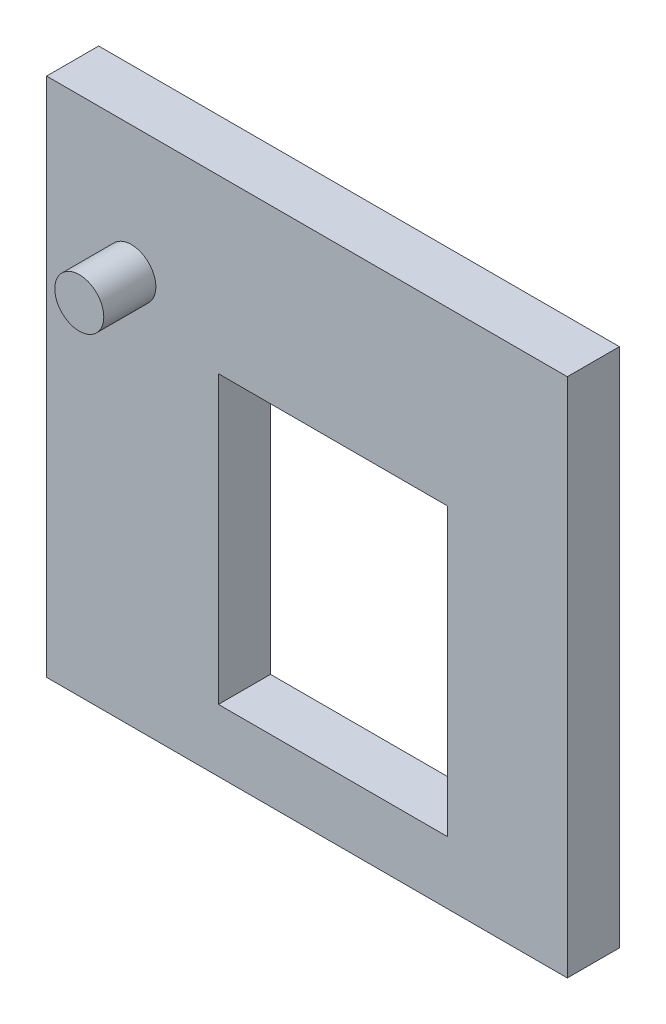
ISO-10303-21;
HEADER;
FILE_DESCRIPTION(('STEP AP214'),'2;1');
FILE_NAME('part.step','',(''),(''),'','','');
FILE_SCHEMA(('AUTOMOTIVE_DESIGN { 1 0 10303 214 1 1 1 1 }'));
ENDSEC;
DATA;
#1=APPLICATION_CONTEXT('core data for automotive mechanical design processes');
#2=APPLICATION_PROTOCOL_DEFINITION('international standard','automotive_design',2000,#1);
#3=PRODUCT_CONTEXT('',#1,'mechanical');
#4=PRODUCT('Part','Part','',(#3));
#5=PRODUCT_RELATED_PRODUCT_CATEGORY('part','',(#4));
#6=PRODUCT_DEFINITION_FORMATION('','',#4);
#7=PRODUCT_DEFINITION_CONTEXT('part definition',#1,'design');
#8=PRODUCT_DEFINITION('design','',#6,#7);
#9=PRODUCT_DEFINITION_SHAPE('','',#8);
#10=(LENGTH_UNIT() NAMED_UNIT(*) SI_UNIT(.MILLI.,.METRE.));
#11=(NAMED_UNIT(*) PLANE_ANGLE_UNIT() SI_UNIT($,.RADIAN.));
#12=(NAMED_UNIT(*) SI_UNIT($,.STERADIAN.) SOLID_ANGLE_UNIT());
#13=UNCERTAINTY_MEASURE_WITH_UNIT(LENGTH_MEASURE(1.E-05),#10,'distance_accuracy_value','');
#14=(GEOMETRIC_REPRESENTATION_CONTEXT(3) GLOBAL_UNCERTAINTY_ASSIGNED_CONTEXT((#13)) GLOBAL_UNIT_ASSIGNED_CONTEXT((#10,
#11,#12)) REPRESENTATION_CONTEXT('',''));
#15=CARTESIAN_POINT('',(0.,0.,0.));
#16=DIRECTION('',(0.,0.,1.));
#17=DIRECTION('',(1.,0.,0.));
#18=AXIS2_PLACEMENT_3D('',#15,#16,#17);
#19=CARTESIAN_POINT('',(-50.,-50.,5.));
#20=DIRECTION('',(0.,0.,-1.));
#21=DIRECTION('',(-1.,0.,0.));
#22=AXIS2_PLACEMENT_3D('',#19,#20,#21);
#23=PLANE('',#22);
#24=DIRECTION('',(-1.,0.,0.));
#25=VECTOR('',#24,1.);
#26=CARTESIAN_POINT('',(-50.,-50.,5.));
#27=LINE('',#26,#25);
#28=CARTESIAN_POINT('',(50.,-50.,5.));
#29=VERTEX_POINT('',#28);
#30=CARTESIAN_POINT('',(-50.,-50.,5.));
#31=VERTEX_POINT('',#30);
#32=EDGE_CURVE('E133',#29,#31,#27,.T.);
#33=ORIENTED_EDGE('',*,*,#32,.F.);
#34=DIRECTION('',(0.,-1.,0.));
#35=VECTOR('',#34,1.);
#36=CARTESIAN_POINT('',(50.,-50.,5.));
#37=LINE('',#36,#35);
#38=CARTESIAN_POINT('',(50.,50.,5.));
#39=VERTEX_POINT('',#38);
#40=EDGE_CURVE('E141',#39,#29,#37,.T.);
#41=ORIENTED_EDGE('',*,*,#40,.F.);
#42=DIRECTION('',(1.,0.,0.));
#43=VECTOR('',#42,1.);
#44=CARTESIAN_POINT('',(-50.,50.,5.));
#45=LINE('',#44,#43);
#46=CARTESIAN_POINT('',(-50.,50.,5.));
#47=VERTEX_POINT('',#46);
#48=EDGE_CURVE('E152',#47,#39,#45,.T.);
#49=ORIENTED_EDGE('',*,*,#48,.F.);
#50=DIRECTION('',(0.,1.,0.));
#51=VECTOR('',#50,1.);
#52=CARTESIAN_POINT('',(-50.,50.,5.));
#53=LINE('',#52,#51);
#54=EDGE_CURVE('E150',#31,#47,#53,.T.);
#55=ORIENTED_EDGE('',*,*,#54,.F.);
#56=EDGE_LOOP('',(#33,#41,#49,#55));
#57=FACE_BOUND('',#56,.T.);
#58=DIRECTION('',(1.,0.,0.));
#59=VECTOR('',#58,1.);
#60=CARTESIAN_POINT('',(-17.,-38.,5.));
#61=LINE('',#60,#59);
#62=CARTESIAN_POINT('',(-17.,-38.,5.));
#63=VERTEX_POINT('',#62);
#64=CARTESIAN_POINT('',(27.,-38.,5.));
#65=VERTEX_POINT('',#64);
#66=EDGE_CURVE('E127',#63,#65,#61,.T.);
#67=ORIENTED_EDGE('',*,*,#66,.F.);
#68=DIRECTION('',(0.,-1.,0.));
#69=VECTOR('',#68,1.);
#70=CARTESIAN_POINT('',(-17.,-38.,5.));
#71=LINE('',#70,#69);
#72=CARTESIAN_POINT('',(-17.,17.,5.));
#73=VERTEX_POINT('',#72);
#74=EDGE_CURVE('E56',#73,#63,#71,.T.);
#75=ORIENTED_EDGE('',*,*,#74,.F.);
#76=DIRECTION('',(-1.,0.,0.));
#77=VECTOR('',#76,1.);
#78=CARTESIAN_POINT('',(-17.,17.,5.));
#79=LINE('',#78,#77);
#80=CARTESIAN_POINT('',(27.,17.,5.));
#81=VERTEX_POINT('',#80);
#82=EDGE_CURVE('E116',#81,#73,#79,.T.);
#83=ORIENTED_EDGE('',*,*,#82,.F.);
#84=DIRECTION('',(0.,1.,0.));
#85=VECTOR('',#84,1.);
#86=CARTESIAN_POINT('',(27.,-38.,5.));
#87=LINE('',#86,#85);
#88=EDGE_CURVE('E119',#65,#81,#87,.T.);
#89=ORIENTED_EDGE('',*,*,#88,.F.);
#90=EDGE_LOOP('',(#67,#75,#83,#89));
#91=FACE_BOUND('',#90,.T.);
#92=CARTESIAN_POINT('',(-33.7210658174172,25.4187198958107,5.));
#93=DIRECTION('',(0.,0.,-1.));
#94=DIRECTION('',(-1.,0.,0.));
#95=AXIS2_PLACEMENT_3D('',#92,#93,#94);
#96=CIRCLE('',#95,4.70284837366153);
#97=CARTESIAN_POINT('',(-38.4239141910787,25.4187198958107,5.));
#98=VERTEX_POINT('',#97);
#99=EDGE_CURVE('E11',#98,#98,#96,.F.);
#100=ORIENTED_EDGE('',*,*,#99,.F.);
#101=EDGE_LOOP('',(#100));
#102=FACE_BOUND('',#101,.T.);
#103=ADVANCED_FACE('F33',(#57,#91,#102),#23,.F.);
#104=CARTESIAN_POINT('',(-50.,-50.,-5.));
#105=DIRECTION('',(0.,1.,0.));
#106=DIRECTION('',(0.,0.,1.));
#107=AXIS2_PLACEMENT_3D('',#104,#105,#106);
#108=PLANE('',#107);
#109=ORIENTED_EDGE('',*,*,#32,.T.);
#110=DIRECTION('',(0.,0.,1.));
#111=VECTOR('',#110,1.);
#112=CARTESIAN_POINT('',(-50.,-50.,-5.));
#113=LINE('',#112,#111);
#114=CARTESIAN_POINT('',(-50.,-50.,-5.));
#115=VERTEX_POINT('',#114);
#116=EDGE_CURVE('E41',#115,#31,#113,.T.);
#117=ORIENTED_EDGE('',*,*,#116,.F.);
#118=DIRECTION('',(-1.,0.,0.));
#119=VECTOR('',#118,1.);
#120=CARTESIAN_POINT('',(-50.,-50.,-5.));
#121=LINE('',#120,#119);
#122=CARTESIAN_POINT('',(50.,-50.,-5.));
#123=VERTEX_POINT('',#122);
#124=EDGE_CURVE('E137',#123,#115,#121,.T.);
#125=ORIENTED_EDGE('',*,*,#124,.F.);
#126=DIRECTION('',(0.,0.,1.));
#127=VECTOR('',#126,1.);
#128=CARTESIAN_POINT('',(50.,-50.,-5.));
#129=LINE('',#128,#127);
#130=EDGE_CURVE('E147',#123,#29,#129,.T.);
#131=ORIENTED_EDGE('',*,*,#130,.T.);
#132=EDGE_LOOP('',(#109,#117,#125,#131));
#133=FACE_BOUND('',#132,.T.);
#134=ADVANCED_FACE('F35',(#133),#108,.F.);
#135=CARTESIAN_POINT('',(-50.,50.,-5.));
#136=DIRECTION('',(1.,0.,0.));
#137=DIRECTION('',(0.,1.,0.));
#138=AXIS2_PLACEMENT_3D('',#135,#136,#137);
#139=PLANE('',#138);
#140=ORIENTED_EDGE('',*,*,#54,.T.);
#141=DIRECTION('',(0.,0.,1.));
#142=VECTOR('',#141,1.);
#143=CARTESIAN_POINT('',(-50.,50.,-5.));
#144=LINE('',#143,#142);
#145=CARTESIAN_POINT('',(-50.,50.,-5.));
#146=VERTEX_POINT('',#145);
#147=EDGE_CURVE('E160',#146,#47,#144,.T.);
#148=ORIENTED_EDGE('',*,*,#147,.F.);
#149=DIRECTION('',(0.,1.,0.));
#150=VECTOR('',#149,1.);
#151=CARTESIAN_POINT('',(-50.,50.,-5.));
#152=LINE('',#151,#150);
#153=EDGE_CURVE('E140',#115,#146,#152,.T.);
#154=ORIENTED_EDGE('',*,*,#153,.F.);
#155=ORIENTED_EDGE('',*,*,#116,.T.);
#156=EDGE_LOOP('',(#140,#148,#154,#155));
#157=FACE_BOUND('',#156,.T.);
#158=ADVANCED_FACE('F165',(#157),#139,.F.);
#159=CARTESIAN_POINT('',(-50.,50.,-5.));
#160=DIRECTION('',(0.,-1.,0.));
#161=DIRECTION('',(1.,0.,0.));
#162=AXIS2_PLACEMENT_3D('',#159,#160,#161);
#163=PLANE('',#162);
#164=ORIENTED_EDGE('',*,*,#48,.T.);
#165=DIRECTION('',(0.,0.,1.));
#166=VECTOR('',#165,1.);
#167=CARTESIAN_POINT('',(50.,50.,-5.));
#168=LINE('',#167,#166);
#169=CARTESIAN_POINT('',(50.,50.,-5.));
#170=VERTEX_POINT('',#169);
#171=EDGE_CURVE('E157',#170,#39,#168,.T.);
#172=ORIENTED_EDGE('',*,*,#171,.F.);
#173=DIRECTION('',(1.,0.,0.));
#174=VECTOR('',#173,1.);
#175=CARTESIAN_POINT('',(-50.,50.,-5.));
#176=LINE('',#175,#174);
#177=EDGE_CURVE('E143',#146,#170,#176,.T.);
#178=ORIENTED_EDGE('',*,*,#177,.F.);
#179=ORIENTED_EDGE('',*,*,#147,.T.);
#180=EDGE_LOOP('',(#164,#172,#178,#179));
#181=FACE_BOUND('',#180,.T.);
#182=ADVANCED_FACE('F177',(#181),#163,.F.);
#183=CARTESIAN_POINT('',(50.,-50.,-5.));
#184=DIRECTION('',(-1.,0.,0.));
#185=DIRECTION('',(0.,-1.,0.));
#186=AXIS2_PLACEMENT_3D('',#183,#184,#185);
#187=PLANE('',#186);
#188=ORIENTED_EDGE('',*,*,#40,.T.);
#189=ORIENTED_EDGE('',*,*,#130,.F.);
#190=DIRECTION('',(0.,-1.,0.));
#191=VECTOR('',#190,1.);
#192=CARTESIAN_POINT('',(50.,-50.,-5.));
#193=LINE('',#192,#191);
#194=EDGE_CURVE('E145',#170,#123,#193,.T.);
#195=ORIENTED_EDGE('',*,*,#194,.F.);
#196=ORIENTED_EDGE('',*,*,#171,.T.);
#197=EDGE_LOOP('',(#188,#189,#195,#196));
#198=FACE_BOUND('',#197,.T.);
#199=ADVANCED_FACE('F181',(#198),#187,.F.);
#200=CARTESIAN_POINT('',(-50.,-50.,-5.));
#201=DIRECTION('',(0.,0.,-1.));
#202=DIRECTION('',(-1.,0.,0.));
#203=AXIS2_PLACEMENT_3D('',#200,#201,#202);
#204=PLANE('',#203);
#205=DIRECTION('',(0.,-1.,0.));
#206=VECTOR('',#205,1.);
#207=CARTESIAN_POINT('',(-17.,-38.,-5.));
#208=LINE('',#207,#206);
#209=CARTESIAN_POINT('',(-17.,17.,-5.));
#210=VERTEX_POINT('',#209);
#211=CARTESIAN_POINT('',(-17.,-38.,-5.));
#212=VERTEX_POINT('',#211);
#213=EDGE_CURVE('E100',#210,#212,#208,.T.);
#214=ORIENTED_EDGE('',*,*,#213,.T.);
#215=DIRECTION('',(1.,0.,0.));
#216=VECTOR('',#215,1.);
#217=CARTESIAN_POINT('',(-17.,-38.,-5.));
#218=LINE('',#217,#216);
#219=CARTESIAN_POINT('',(27.,-38.,-5.));
#220=VERTEX_POINT('',#219);
#221=EDGE_CURVE('E109',#212,#220,#218,.T.);
#222=ORIENTED_EDGE('',*,*,#221,.T.);
#223=DIRECTION('',(0.,1.,0.));
#224=VECTOR('',#223,1.);
#225=CARTESIAN_POINT('',(27.,-38.,-5.));
#226=LINE('',#225,#224);
#227=CARTESIAN_POINT('',(27.,17.,-5.));
#228=VERTEX_POINT('',#227);
#229=EDGE_CURVE('E48',#220,#228,#226,.T.);
#230=ORIENTED_EDGE('',*,*,#229,.T.);
#231=DIRECTION('',(-1.,0.,0.));
#232=VECTOR('',#231,1.);
#233=CARTESIAN_POINT('',(-17.,17.,-5.));
#234=LINE('',#233,#232);
#235=EDGE_CURVE('E106',#228,#210,#234,.T.);
#236=ORIENTED_EDGE('',*,*,#235,.T.);
#237=EDGE_LOOP('',(#214,#222,#230,#236));
#238=FACE_BOUND('',#237,.T.);
#239=ORIENTED_EDGE('',*,*,#124,.T.);
#240=ORIENTED_EDGE('',*,*,#153,.T.);
#241=ORIENTED_EDGE('',*,*,#177,.T.);
#242=ORIENTED_EDGE('',*,*,#194,.T.);
#243=EDGE_LOOP('',(#239,#240,#241,#242));
#244=FACE_BOUND('',#243,.T.);
#245=ADVANCED_FACE('F113',(#238,#244),#204,.T.);
#246=CARTESIAN_POINT('',(-17.,-38.,-5.));
#247=DIRECTION('',(-1.,0.,0.));
#248=DIRECTION('',(0.,0.,1.));
#249=AXIS2_PLACEMENT_3D('',#246,#247,#248);
#250=PLANE('',#249);
#251=ORIENTED_EDGE('',*,*,#74,.T.);
#252=DIRECTION('',(0.,0.,1.));
#253=VECTOR('',#252,1.);
#254=CARTESIAN_POINT('',(-17.,-38.,-5.));
#255=LINE('',#254,#253);
#256=EDGE_CURVE('E96',#212,#63,#255,.T.);
#257=ORIENTED_EDGE('',*,*,#256,.F.);
#258=ORIENTED_EDGE('',*,*,#213,.F.);
#259=DIRECTION('',(0.,0.,1.));
#260=VECTOR('',#259,1.);
#261=CARTESIAN_POINT('',(-17.,17.,-5.));
#262=LINE('',#261,#260);
#263=EDGE_CURVE('E131',#210,#73,#262,.T.);
#264=ORIENTED_EDGE('',*,*,#263,.T.);
#265=EDGE_LOOP('',(#251,#257,#258,#264));
#266=FACE_BOUND('',#265,.T.);
#267=ADVANCED_FACE('F98',(#266),#250,.F.);
#268=CARTESIAN_POINT('',(-17.,17.,-5.));
#269=DIRECTION('',(0.,1.,0.));
#270=DIRECTION('',(0.,0.,1.));
#271=AXIS2_PLACEMENT_3D('',#268,#269,#270);
#272=PLANE('',#271);
#273=ORIENTED_EDGE('',*,*,#82,.T.);
#274=ORIENTED_EDGE('',*,*,#263,.F.);
#275=ORIENTED_EDGE('',*,*,#235,.F.);
#276=DIRECTION('',(0.,0.,1.));
#277=VECTOR('',#276,1.);
#278=CARTESIAN_POINT('',(27.,17.,-5.));
#279=LINE('',#278,#277);
#280=EDGE_CURVE('E134',#228,#81,#279,.T.);
#281=ORIENTED_EDGE('',*,*,#280,.T.);
#282=EDGE_LOOP('',(#273,#274,#275,#281));
#283=FACE_BOUND('',#282,.T.);
#284=ADVANCED_FACE('F188',(#283),#272,.F.);
#285=CARTESIAN_POINT('',(27.,-38.,-5.));
#286=DIRECTION('',(1.,0.,0.));
#287=DIRECTION('',(0.,0.,-1.));
#288=AXIS2_PLACEMENT_3D('',#285,#286,#287);
#289=PLANE('',#288);
#290=ORIENTED_EDGE('',*,*,#88,.T.);
#291=ORIENTED_EDGE('',*,*,#280,.F.);
#292=ORIENTED_EDGE('',*,*,#229,.F.);
#293=DIRECTION('',(0.,0.,1.));
#294=VECTOR('',#293,1.);
#295=CARTESIAN_POINT('',(27.,-38.,-5.));
#296=LINE('',#295,#294);
#297=EDGE_CURVE('E105',#220,#65,#296,.T.);
#298=ORIENTED_EDGE('',*,*,#297,.T.);
#299=EDGE_LOOP('',(#290,#291,#292,#298));
#300=FACE_BOUND('',#299,.T.);
#301=ADVANCED_FACE('F230',(#300),#289,.F.);
#302=CARTESIAN_POINT('',(-17.,-38.,-5.));
#303=DIRECTION('',(0.,-1.,0.));
#304=DIRECTION('',(0.,0.,-1.));
#305=AXIS2_PLACEMENT_3D('',#302,#303,#304);
#306=PLANE('',#305);
#307=ORIENTED_EDGE('',*,*,#66,.T.);
#308=ORIENTED_EDGE('',*,*,#297,.F.);
#309=ORIENTED_EDGE('',*,*,#221,.F.);
#310=ORIENTED_EDGE('',*,*,#256,.T.);
#311=EDGE_LOOP('',(#307,#308,#309,#310));
#312=FACE_BOUND('',#311,.T.);
#313=ADVANCED_FACE('F110',(#312),#306,.F.);
#314=CARTESIAN_POINT('',(-33.7210658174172,25.4187198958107,15.));
#315=DIRECTION('',(0.,0.,-1.));
#316=DIRECTION('',(-1.,0.,0.));
#317=AXIS2_PLACEMENT_3D('',#314,#315,#316);
#318=CYLINDRICAL_SURFACE('',#317,4.70284837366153);
#319=CARTESIAN_POINT('',(-33.7210658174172,25.4187198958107,15.));
#320=DIRECTION('',(0.,0.,1.));
#321=DIRECTION('',(1.,0.,0.));
#322=AXIS2_PLACEMENT_3D('',#319,#320,#321);
#323=CIRCLE('',#322,4.70284837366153);
#324=CARTESIAN_POINT('',(-29.0182174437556,25.4187198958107,15.));
#325=VERTEX_POINT('',#324);
#326=EDGE_CURVE('E122',#325,#325,#323,.T.);
#327=ORIENTED_EDGE('',*,*,#326,.F.);
#328=EDGE_LOOP('',(#327));
#329=FACE_BOUND('',#328,.T.);
#330=ORIENTED_EDGE('',*,*,#99,.T.);
#331=EDGE_LOOP('',(#330));
#332=FACE_BOUND('',#331,.T.);
#333=ADVANCED_FACE('F247',(#329,#332),#318,.T.);
#334=CARTESIAN_POINT('',(-33.7210658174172,25.4187198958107,15.));
#335=DIRECTION('',(0.,0.,1.));
#336=DIRECTION('',(1.,0.,0.));
#337=AXIS2_PLACEMENT_3D('',#334,#335,#336);
#338=PLANE('',#337);
#339=ORIENTED_EDGE('',*,*,#326,.T.);
#340=EDGE_LOOP('',(#339));
#341=FACE_BOUND('',#340,.T.);
#342=ADVANCED_FACE('F261',(#341),#338,.T.);
#343=CLOSED_SHELL('',(#103,#134,#158,#182,#199,#245,#267,#284,#301,#313,#333,#342));
#344=MANIFOLD_SOLID_BREP('B2',#343);
#345=ADVANCED_BREP_SHAPE_REPRESENTATION('',(#18,#344),#14);
#346=SHAPE_DEFINITION_REPRESENTATION(#9,#345);
ENDSEC;
END-ISO-10303-21;
